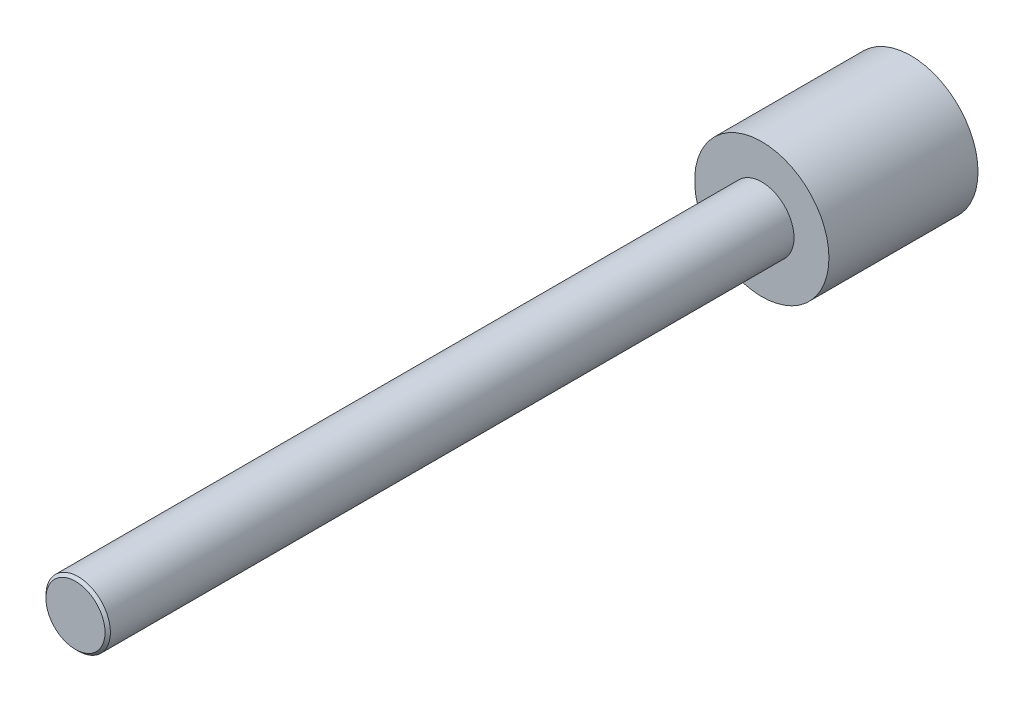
from build123d import *

# Parameters (mm, degrees)
SKETCH1_R           = 3.048
BASE_EXTRUDE_DEPTH  = 78.74
SKETCH2_R           = 6.35
BOSS_EXTRUDE1_DEPTH = 14.097
CHAMFER1_SIZE       = 0.254


with BuildPart() as part:
    # Sketch1 → Base-Extrude (new body)
    with BuildSketch(Plane.XY):
        Circle(SKETCH1_R)
    extrude(amount=BASE_EXTRUDE_DEPTH)

    # Sketch2 → Boss-Extrude1 (add)
    with BuildSketch(Plane.XY.offset(-0.254)):
        Circle(SKETCH2_R)
    extrude(amount=BOSS_EXTRUDE1_DEPTH)

    # Chamfer1
    chamfer1_edges = [part.edges().sort_by_distance(p)[0] for p in [
        (-3.048, 0, 78.74),
    ]]
    chamfer(chamfer1_edges, length=CHAMFER1_SIZE)


solid = part.part
